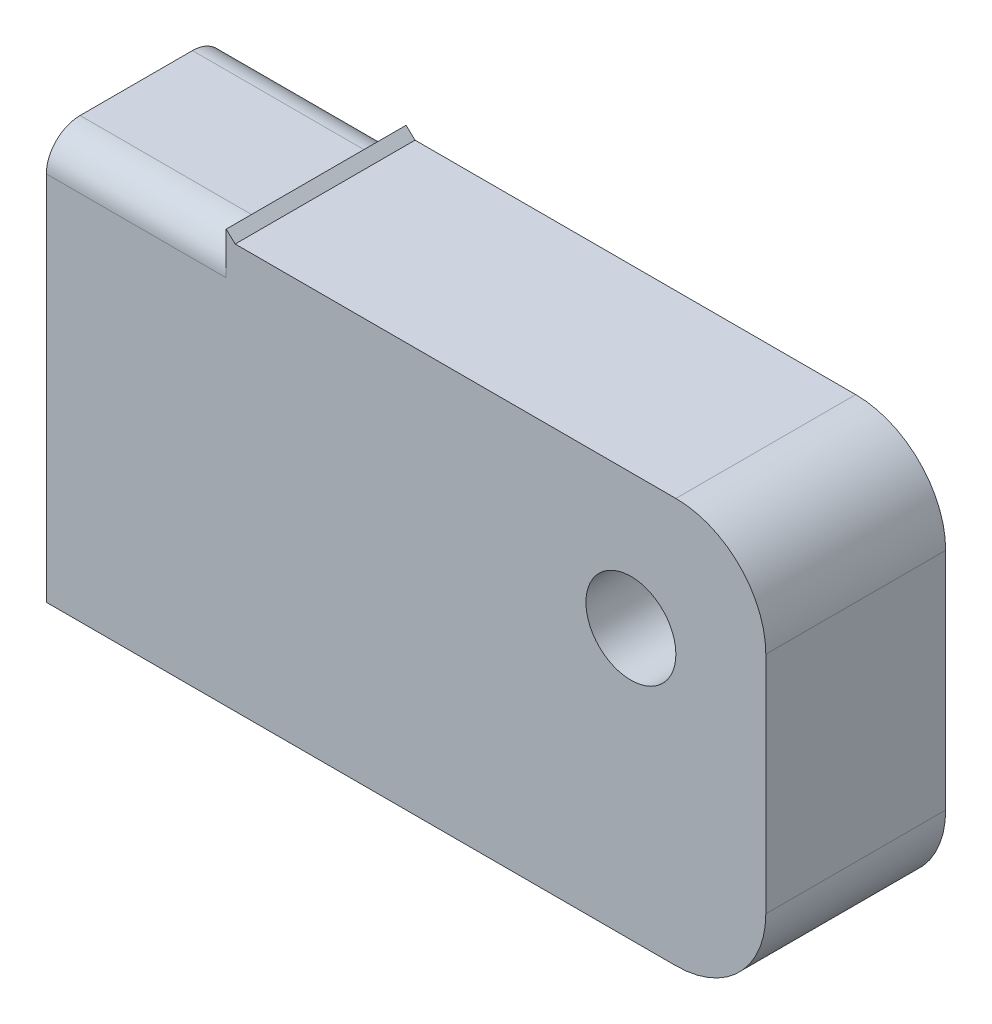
from build123d import *

# Parameters (mm, degrees)
SKETCH1_W          = 203.2
SKETCH1_H          = 114.3
EXTRUDE1_DEPTH     = 50.8
SKETCH2_R          = 12.7
CUT_EXTRUDE1_DEPTH = 239.611336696
FILLET1_R          = 25.4
EXTRUDE2_DEPTH     = 50.8
FILLET5_R          = 9.525


with BuildPart() as part:
    # Sketch1 → Extrude1 (new body)
    with BuildSketch(Plane.XY):
        with Locations((-101.6, -57.15)):
            Rectangle(SKETCH1_W, SKETCH1_H)
    extrude(amount=EXTRUDE1_DEPTH)

    # Sketch2 → Cut-Extrude1 (cut, through all)
    with BuildSketch(Plane.XY.offset(50.8)):
        with Locations((-38.1, -38.1)):
            Circle(SKETCH2_R)
    extrude(amount=-CUT_EXTRUDE1_DEPTH, mode=Mode.SUBTRACT)

    # Fillet1
    fillet1_edges = [part.edges().sort_by_distance(p)[0] for p in [
        (0, -114.3, 25.4),
        (0, 0, 25.4),
    ]]
    fillet(fillet1_edges, radius=FILLET1_R)

    # Sketch3 → Extrude2 (add, through all)
    with BuildSketch(Plane.XY.offset(50.8)):
        Polygon((-152.4, 0), (-152.4, 2.370780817), (-149.86, 0), align=None)
    extrude(amount=-EXTRUDE2_DEPTH)

    # Fillet5
    fillet5_edges = [part.edges().sort_by_distance(p)[0] for p in [
        (-177.8, 0, 0),
        (-177.8, 0, 50.8),
    ]]
    fillet(fillet5_edges, radius=FILLET5_R)


solid = part.part
